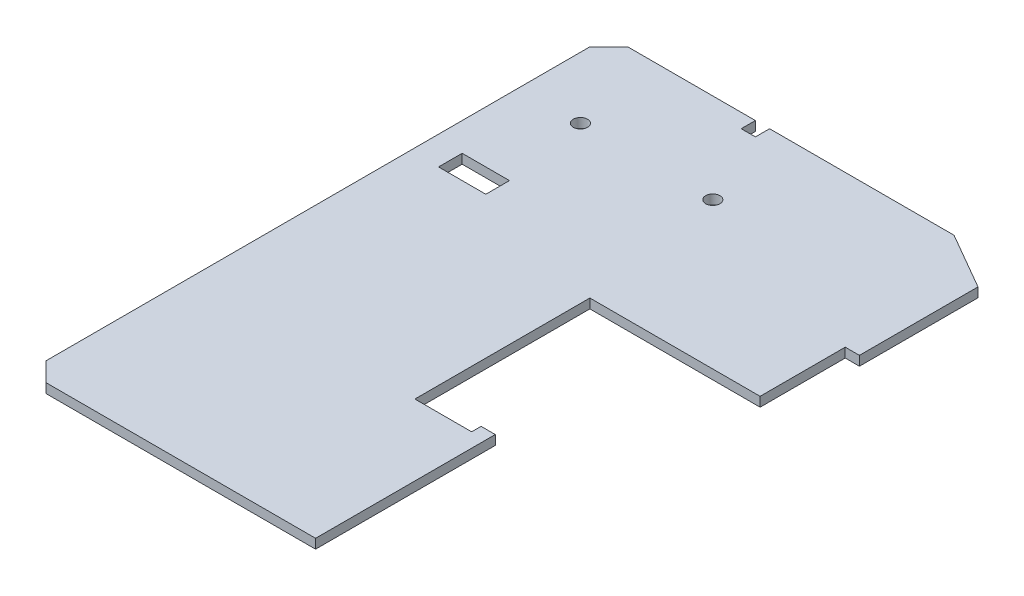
ISO-10303-21;
HEADER;
FILE_DESCRIPTION(('STEP AP214'),'2;1');
FILE_NAME('part.step','',(''),(''),'','','');
FILE_SCHEMA(('AUTOMOTIVE_DESIGN { 1 0 10303 214 1 1 1 1 }'));
ENDSEC;
DATA;
#1=APPLICATION_CONTEXT('core data for automotive mechanical design processes');
#2=APPLICATION_PROTOCOL_DEFINITION('international standard','automotive_design',2000,#1);
#3=PRODUCT_CONTEXT('',#1,'mechanical');
#4=PRODUCT('Part','Part','',(#3));
#5=PRODUCT_RELATED_PRODUCT_CATEGORY('part','',(#4));
#6=PRODUCT_DEFINITION_FORMATION('','',#4);
#7=PRODUCT_DEFINITION_CONTEXT('part definition',#1,'design');
#8=PRODUCT_DEFINITION('design','',#6,#7);
#9=PRODUCT_DEFINITION_SHAPE('','',#8);
#10=(LENGTH_UNIT() NAMED_UNIT(*) SI_UNIT(.MILLI.,.METRE.));
#11=(NAMED_UNIT(*) PLANE_ANGLE_UNIT() SI_UNIT($,.RADIAN.));
#12=(NAMED_UNIT(*) SI_UNIT($,.STERADIAN.) SOLID_ANGLE_UNIT());
#13=UNCERTAINTY_MEASURE_WITH_UNIT(LENGTH_MEASURE(1.E-05),#10,'distance_accuracy_value','');
#14=(GEOMETRIC_REPRESENTATION_CONTEXT(3) GLOBAL_UNCERTAINTY_ASSIGNED_CONTEXT((#13)) GLOBAL_UNIT_ASSIGNED_CONTEXT((#10,
#11,#12)) REPRESENTATION_CONTEXT('',''));
#15=CARTESIAN_POINT('',(0.,0.,0.));
#16=DIRECTION('',(0.,0.,1.));
#17=DIRECTION('',(1.,0.,0.));
#18=AXIS2_PLACEMENT_3D('',#15,#16,#17);
#19=CARTESIAN_POINT('',(-51.75,1.,-12.7500000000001));
#20=DIRECTION('',(0.,-1.,0.));
#21=DIRECTION('',(0.,0.,-1.));
#22=AXIS2_PLACEMENT_3D('',#19,#20,#21);
#23=PLANE('',#22);
#24=CARTESIAN_POINT('',(-16.5,1.,-34.));
#25=DIRECTION('',(0.,1.,0.));
#26=DIRECTION('',(0.,0.,1.));
#27=AXIS2_PLACEMENT_3D('',#24,#25,#26);
#28=CIRCLE('',#27,0.750000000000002);
#29=CARTESIAN_POINT('',(-16.5,1.,-33.25));
#30=VERTEX_POINT('',#29);
#31=EDGE_CURVE('E212',#30,#30,#28,.T.);
#32=ORIENTED_EDGE('',*,*,#31,.F.);
#33=EDGE_LOOP('',(#32));
#34=FACE_BOUND('',#33,.T.);
#35=DIRECTION('',(0.707106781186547,0.,0.707106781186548));
#36=VECTOR('',#35,1.);
#37=CARTESIAN_POINT('',(-21.,1.,18.));
#38=LINE('',#37,#36);
#39=CARTESIAN_POINT('',(-23.,1.,16.));
#40=VERTEX_POINT('',#39);
#41=CARTESIAN_POINT('',(-21.,1.,18.));
#42=VERTEX_POINT('',#41);
#43=EDGE_CURVE('E270',#40,#42,#38,.T.);
#44=ORIENTED_EDGE('',*,*,#43,.T.);
#45=DIRECTION('',(1.,0.,0.));
#46=VECTOR('',#45,1.);
#47=CARTESIAN_POINT('',(7.5,1.,18.));
#48=LINE('',#47,#46);
#49=CARTESIAN_POINT('',(7.5,1.,18.));
#50=VERTEX_POINT('',#49);
#51=EDGE_CURVE('E273',#42,#50,#48,.T.);
#52=ORIENTED_EDGE('',*,*,#51,.T.);
#53=DIRECTION('',(0.,0.,-1.));
#54=VECTOR('',#53,1.);
#55=CARTESIAN_POINT('',(7.5,1.,-1.));
#56=LINE('',#55,#54);
#57=CARTESIAN_POINT('',(7.5,1.,-1.));
#58=VERTEX_POINT('',#57);
#59=EDGE_CURVE('E275',#50,#58,#56,.T.);
#60=ORIENTED_EDGE('',*,*,#59,.T.);
#61=DIRECTION('',(-1.,0.,0.));
#62=VECTOR('',#61,1.);
#63=CARTESIAN_POINT('',(6.,1.,-1.));
#64=LINE('',#63,#62);
#65=CARTESIAN_POINT('',(6.,1.,-1.));
#66=VERTEX_POINT('',#65);
#67=EDGE_CURVE('E277',#58,#66,#64,.T.);
#68=ORIENTED_EDGE('',*,*,#67,.T.);
#69=DIRECTION('',(0.,0.,1.));
#70=VECTOR('',#69,1.);
#71=CARTESIAN_POINT('',(6.,1.,0.));
#72=LINE('',#71,#70);
#73=CARTESIAN_POINT('',(6.,1.,0.));
#74=VERTEX_POINT('',#73);
#75=EDGE_CURVE('E279',#66,#74,#72,.T.);
#76=ORIENTED_EDGE('',*,*,#75,.T.);
#77=DIRECTION('',(-1.,0.,0.));
#78=VECTOR('',#77,1.);
#79=CARTESIAN_POINT('',(0.,1.,0.));
#80=LINE('',#79,#78);
#81=CARTESIAN_POINT('',(0.,1.,0.));
#82=VERTEX_POINT('',#81);
#83=EDGE_CURVE('E281',#74,#82,#80,.T.);
#84=ORIENTED_EDGE('',*,*,#83,.T.);
#85=DIRECTION('',(0.,0.,-1.));
#86=VECTOR('',#85,1.);
#87=CARTESIAN_POINT('',(0.,1.,-18.5));
#88=LINE('',#87,#86);
#89=CARTESIAN_POINT('',(0.,1.,-18.5));
#90=VERTEX_POINT('',#89);
#91=EDGE_CURVE('E283',#82,#90,#88,.T.);
#92=ORIENTED_EDGE('',*,*,#91,.T.);
#93=DIRECTION('',(1.,0.,0.));
#94=VECTOR('',#93,1.);
#95=CARTESIAN_POINT('',(18.,1.,-18.5));
#96=LINE('',#95,#94);
#97=CARTESIAN_POINT('',(18.,1.,-18.5));
#98=VERTEX_POINT('',#97);
#99=EDGE_CURVE('E285',#90,#98,#96,.T.);
#100=ORIENTED_EDGE('',*,*,#99,.T.);
#101=DIRECTION('',(0.,0.,-1.));
#102=VECTOR('',#101,1.);
#103=CARTESIAN_POINT('',(18.,1.,-27.5));
#104=LINE('',#103,#102);
#105=CARTESIAN_POINT('',(18.,1.,-27.5));
#106=VERTEX_POINT('',#105);
#107=EDGE_CURVE('E287',#98,#106,#104,.T.);
#108=ORIENTED_EDGE('',*,*,#107,.T.);
#109=DIRECTION('',(1.,0.,0.));
#110=VECTOR('',#109,1.);
#111=CARTESIAN_POINT('',(19.5,1.,-27.5));
#112=LINE('',#111,#110);
#113=CARTESIAN_POINT('',(19.5,1.,-27.5));
#114=VERTEX_POINT('',#113);
#115=EDGE_CURVE('E289',#106,#114,#112,.T.);
#116=ORIENTED_EDGE('',*,*,#115,.T.);
#117=DIRECTION('',(0.,0.,-1.));
#118=VECTOR('',#117,1.);
#119=CARTESIAN_POINT('',(19.5,1.,-40.0358983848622));
#120=LINE('',#119,#118);
#121=CARTESIAN_POINT('',(19.5,1.,-40.0358983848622));
#122=VERTEX_POINT('',#121);
#123=EDGE_CURVE('E291',#114,#122,#120,.T.);
#124=ORIENTED_EDGE('',*,*,#123,.T.);
#125=DIRECTION('',(-0.866025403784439,0.,-0.5));
#126=VECTOR('',#125,1.);
#127=CARTESIAN_POINT('',(13.5,1.,-43.5));
#128=LINE('',#127,#126);
#129=CARTESIAN_POINT('',(13.5,1.,-43.5));
#130=VERTEX_POINT('',#129);
#131=EDGE_CURVE('E293',#122,#130,#128,.T.);
#132=ORIENTED_EDGE('',*,*,#131,.T.);
#133=DIRECTION('',(-1.,0.,0.));
#134=VECTOR('',#133,1.);
#135=CARTESIAN_POINT('',(-6.,1.,-43.5));
#136=LINE('',#135,#134);
#137=CARTESIAN_POINT('',(-6.,1.,-43.5));
#138=VERTEX_POINT('',#137);
#139=EDGE_CURVE('E295',#130,#138,#136,.T.);
#140=ORIENTED_EDGE('',*,*,#139,.T.);
#141=DIRECTION('',(0.,0.,1.));
#142=VECTOR('',#141,1.);
#143=CARTESIAN_POINT('',(-6.,1.,-42.));
#144=LINE('',#143,#142);
#145=CARTESIAN_POINT('',(-6.,1.,-42.));
#146=VERTEX_POINT('',#145);
#147=EDGE_CURVE('E297',#138,#146,#144,.T.);
#148=ORIENTED_EDGE('',*,*,#147,.T.);
#149=DIRECTION('',(-1.,0.,0.));
#150=VECTOR('',#149,1.);
#151=CARTESIAN_POINT('',(-7.5,1.,-42.));
#152=LINE('',#151,#150);
#153=CARTESIAN_POINT('',(-7.5,1.,-42.));
#154=VERTEX_POINT('',#153);
#155=EDGE_CURVE('E299',#146,#154,#152,.T.);
#156=ORIENTED_EDGE('',*,*,#155,.T.);
#157=DIRECTION('',(0.,0.,-1.));
#158=VECTOR('',#157,1.);
#159=CARTESIAN_POINT('',(-7.5,1.,-43.5));
#160=LINE('',#159,#158);
#161=CARTESIAN_POINT('',(-7.5,1.,-43.5));
#162=VERTEX_POINT('',#161);
#163=EDGE_CURVE('E301',#154,#162,#160,.T.);
#164=ORIENTED_EDGE('',*,*,#163,.T.);
#165=DIRECTION('',(-1.,0.,0.));
#166=VECTOR('',#165,1.);
#167=CARTESIAN_POINT('',(-21.,1.,-43.5));
#168=LINE('',#167,#166);
#169=CARTESIAN_POINT('',(-21.,1.,-43.5));
#170=VERTEX_POINT('',#169);
#171=EDGE_CURVE('E303',#162,#170,#168,.T.);
#172=ORIENTED_EDGE('',*,*,#171,.T.);
#173=DIRECTION('',(-0.707106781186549,0.,0.707106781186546));
#174=VECTOR('',#173,1.);
#175=CARTESIAN_POINT('',(-23.,1.,-41.5));
#176=LINE('',#175,#174);
#177=CARTESIAN_POINT('',(-23.,1.,-41.5));
#178=VERTEX_POINT('',#177);
#179=EDGE_CURVE('E305',#170,#178,#176,.T.);
#180=ORIENTED_EDGE('',*,*,#179,.T.);
#181=DIRECTION('',(0.,0.,1.));
#182=VECTOR('',#181,1.);
#183=CARTESIAN_POINT('',(-23.,1.,16.));
#184=LINE('',#183,#182);
#185=EDGE_CURVE('E307',#178,#40,#184,.T.);
#186=ORIENTED_EDGE('',*,*,#185,.T.);
#187=EDGE_LOOP('',(#44,#52,#60,#68,#76,#84,#92,#100,#108,#116,#124,#132,#140,#148,#156,#164,
#172,#180,#186));
#188=FACE_BOUND('',#187,.T.);
#189=DIRECTION('',(0.,0.,1.));
#190=VECTOR('',#189,1.);
#191=CARTESIAN_POINT('',(-20.,1.,-25.));
#192=LINE('',#191,#190);
#193=CARTESIAN_POINT('',(-20.,1.,-25.));
#194=VERTEX_POINT('',#193);
#195=CARTESIAN_POINT('',(-20.,1.,-22.5));
#196=VERTEX_POINT('',#195);
#197=EDGE_CURVE('E205',#194,#196,#192,.T.);
#198=ORIENTED_EDGE('',*,*,#197,.F.);
#199=DIRECTION('',(-1.,0.,0.));
#200=VECTOR('',#199,1.);
#201=CARTESIAN_POINT('',(-20.,1.,-25.));
#202=LINE('',#201,#200);
#203=CARTESIAN_POINT('',(-15.,1.,-25.));
#204=VERTEX_POINT('',#203);
#205=EDGE_CURVE('E226',#204,#194,#202,.T.);
#206=ORIENTED_EDGE('',*,*,#205,.F.);
#207=DIRECTION('',(0.,0.,-1.));
#208=VECTOR('',#207,1.);
#209=CARTESIAN_POINT('',(-15.,1.,-25.));
#210=LINE('',#209,#208);
#211=CARTESIAN_POINT('',(-15.,1.,-22.5));
#212=VERTEX_POINT('',#211);
#213=EDGE_CURVE('E224',#212,#204,#210,.T.);
#214=ORIENTED_EDGE('',*,*,#213,.F.);
#215=DIRECTION('',(1.,0.,0.));
#216=VECTOR('',#215,1.);
#217=CARTESIAN_POINT('',(-20.,1.,-22.5));
#218=LINE('',#217,#216);
#219=EDGE_CURVE('E222',#196,#212,#218,.T.);
#220=ORIENTED_EDGE('',*,*,#219,.F.);
#221=EDGE_LOOP('',(#198,#206,#214,#220));
#222=FACE_BOUND('',#221,.T.);
#223=CARTESIAN_POINT('',(-2.5,1.,-34.));
#224=DIRECTION('',(0.,1.,0.));
#225=DIRECTION('',(0.,0.,1.));
#226=AXIS2_PLACEMENT_3D('',#223,#224,#225);
#227=CIRCLE('',#226,0.750000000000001);
#228=CARTESIAN_POINT('',(-2.5,1.,-33.25));
#229=VERTEX_POINT('',#228);
#230=EDGE_CURVE('E684',#229,#229,#227,.T.);
#231=ORIENTED_EDGE('',*,*,#230,.F.);
#232=EDGE_LOOP('',(#231));
#233=FACE_BOUND('',#232,.T.);
#234=ADVANCED_FACE('F35',(#34,#188,#222,#233),#23,.F.);
#235=CARTESIAN_POINT('',(-51.75,0.,-12.7500000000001));
#236=DIRECTION('',(0.,-1.,0.));
#237=DIRECTION('',(0.,0.,-1.));
#238=AXIS2_PLACEMENT_3D('',#235,#236,#237);
#239=PLANE('',#238);
#240=CARTESIAN_POINT('',(-16.5,0.,-34.));
#241=DIRECTION('',(0.,1.,0.));
#242=DIRECTION('',(0.,0.,1.));
#243=AXIS2_PLACEMENT_3D('',#240,#241,#242);
#244=CIRCLE('',#243,0.750000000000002);
#245=CARTESIAN_POINT('',(-16.5,0.,-33.25));
#246=VERTEX_POINT('',#245);
#247=EDGE_CURVE('E215',#246,#246,#244,.T.);
#248=ORIENTED_EDGE('',*,*,#247,.T.);
#249=EDGE_LOOP('',(#248));
#250=FACE_BOUND('',#249,.T.);
#251=DIRECTION('',(0.707106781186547,0.,0.707106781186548));
#252=VECTOR('',#251,1.);
#253=CARTESIAN_POINT('',(-21.,0.,18.));
#254=LINE('',#253,#252);
#255=CARTESIAN_POINT('',(-23.,0.,16.));
#256=VERTEX_POINT('',#255);
#257=CARTESIAN_POINT('',(-21.,0.,18.));
#258=VERTEX_POINT('',#257);
#259=EDGE_CURVE('E206',#256,#258,#254,.T.);
#260=ORIENTED_EDGE('',*,*,#259,.F.);
#261=DIRECTION('',(0.,0.,1.));
#262=VECTOR('',#261,1.);
#263=CARTESIAN_POINT('',(-23.,0.,16.));
#264=LINE('',#263,#262);
#265=CARTESIAN_POINT('',(-23.,0.,-41.5));
#266=VERTEX_POINT('',#265);
#267=EDGE_CURVE('E268',#266,#256,#264,.T.);
#268=ORIENTED_EDGE('',*,*,#267,.F.);
#269=DIRECTION('',(-0.707106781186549,0.,0.707106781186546));
#270=VECTOR('',#269,1.);
#271=CARTESIAN_POINT('',(-23.,0.,-41.5));
#272=LINE('',#271,#270);
#273=CARTESIAN_POINT('',(-21.,0.,-43.5));
#274=VERTEX_POINT('',#273);
#275=EDGE_CURVE('E266',#274,#266,#272,.T.);
#276=ORIENTED_EDGE('',*,*,#275,.F.);
#277=DIRECTION('',(-1.,0.,0.));
#278=VECTOR('',#277,1.);
#279=CARTESIAN_POINT('',(-21.,0.,-43.5));
#280=LINE('',#279,#278);
#281=CARTESIAN_POINT('',(-7.5,0.,-43.5));
#282=VERTEX_POINT('',#281);
#283=EDGE_CURVE('E264',#282,#274,#280,.T.);
#284=ORIENTED_EDGE('',*,*,#283,.F.);
#285=DIRECTION('',(0.,0.,-1.));
#286=VECTOR('',#285,1.);
#287=CARTESIAN_POINT('',(-7.5,0.,-43.5));
#288=LINE('',#287,#286);
#289=CARTESIAN_POINT('',(-7.5,0.,-42.));
#290=VERTEX_POINT('',#289);
#291=EDGE_CURVE('E262',#290,#282,#288,.T.);
#292=ORIENTED_EDGE('',*,*,#291,.F.);
#293=DIRECTION('',(-1.,0.,0.));
#294=VECTOR('',#293,1.);
#295=CARTESIAN_POINT('',(-7.5,0.,-42.));
#296=LINE('',#295,#294);
#297=CARTESIAN_POINT('',(-6.,0.,-42.));
#298=VERTEX_POINT('',#297);
#299=EDGE_CURVE('E260',#298,#290,#296,.T.);
#300=ORIENTED_EDGE('',*,*,#299,.F.);
#301=DIRECTION('',(0.,0.,1.));
#302=VECTOR('',#301,1.);
#303=CARTESIAN_POINT('',(-6.,0.,-42.));
#304=LINE('',#303,#302);
#305=CARTESIAN_POINT('',(-6.,0.,-43.5));
#306=VERTEX_POINT('',#305);
#307=EDGE_CURVE('E258',#306,#298,#304,.T.);
#308=ORIENTED_EDGE('',*,*,#307,.F.);
#309=DIRECTION('',(-1.,0.,0.));
#310=VECTOR('',#309,1.);
#311=CARTESIAN_POINT('',(-6.,0.,-43.5));
#312=LINE('',#311,#310);
#313=CARTESIAN_POINT('',(13.5,0.,-43.5));
#314=VERTEX_POINT('',#313);
#315=EDGE_CURVE('E256',#314,#306,#312,.T.);
#316=ORIENTED_EDGE('',*,*,#315,.F.);
#317=DIRECTION('',(-0.866025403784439,0.,-0.5));
#318=VECTOR('',#317,1.);
#319=CARTESIAN_POINT('',(13.5,0.,-43.5));
#320=LINE('',#319,#318);
#321=CARTESIAN_POINT('',(19.5,0.,-40.0358983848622));
#322=VERTEX_POINT('',#321);
#323=EDGE_CURVE('E254',#322,#314,#320,.T.);
#324=ORIENTED_EDGE('',*,*,#323,.F.);
#325=DIRECTION('',(0.,0.,-1.));
#326=VECTOR('',#325,1.);
#327=CARTESIAN_POINT('',(19.5,0.,-40.0358983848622));
#328=LINE('',#327,#326);
#329=CARTESIAN_POINT('',(19.5,0.,-27.5));
#330=VERTEX_POINT('',#329);
#331=EDGE_CURVE('E252',#330,#322,#328,.T.);
#332=ORIENTED_EDGE('',*,*,#331,.F.);
#333=DIRECTION('',(1.,0.,0.));
#334=VECTOR('',#333,1.);
#335=CARTESIAN_POINT('',(19.5,0.,-27.5));
#336=LINE('',#335,#334);
#337=CARTESIAN_POINT('',(18.,0.,-27.5));
#338=VERTEX_POINT('',#337);
#339=EDGE_CURVE('E250',#338,#330,#336,.T.);
#340=ORIENTED_EDGE('',*,*,#339,.F.);
#341=DIRECTION('',(0.,0.,-1.));
#342=VECTOR('',#341,1.);
#343=CARTESIAN_POINT('',(18.,0.,-27.5));
#344=LINE('',#343,#342);
#345=CARTESIAN_POINT('',(18.,0.,-18.5));
#346=VERTEX_POINT('',#345);
#347=EDGE_CURVE('E248',#346,#338,#344,.T.);
#348=ORIENTED_EDGE('',*,*,#347,.F.);
#349=DIRECTION('',(1.,0.,0.));
#350=VECTOR('',#349,1.);
#351=CARTESIAN_POINT('',(18.,0.,-18.5));
#352=LINE('',#351,#350);
#353=CARTESIAN_POINT('',(0.,0.,-18.5));
#354=VERTEX_POINT('',#353);
#355=EDGE_CURVE('E246',#354,#346,#352,.T.);
#356=ORIENTED_EDGE('',*,*,#355,.F.);
#357=DIRECTION('',(0.,0.,-1.));
#358=VECTOR('',#357,1.);
#359=CARTESIAN_POINT('',(0.,0.,-18.5));
#360=LINE('',#359,#358);
#361=CARTESIAN_POINT('',(0.,0.,0.));
#362=VERTEX_POINT('',#361);
#363=EDGE_CURVE('E244',#362,#354,#360,.T.);
#364=ORIENTED_EDGE('',*,*,#363,.F.);
#365=DIRECTION('',(-1.,0.,0.));
#366=VECTOR('',#365,1.);
#367=CARTESIAN_POINT('',(0.,0.,0.));
#368=LINE('',#367,#366);
#369=CARTESIAN_POINT('',(6.,0.,0.));
#370=VERTEX_POINT('',#369);
#371=EDGE_CURVE('E242',#370,#362,#368,.T.);
#372=ORIENTED_EDGE('',*,*,#371,.F.);
#373=DIRECTION('',(0.,0.,1.));
#374=VECTOR('',#373,1.);
#375=CARTESIAN_POINT('',(6.,0.,0.));
#376=LINE('',#375,#374);
#377=CARTESIAN_POINT('',(6.,0.,-1.));
#378=VERTEX_POINT('',#377);
#379=EDGE_CURVE('E240',#378,#370,#376,.T.);
#380=ORIENTED_EDGE('',*,*,#379,.F.);
#381=DIRECTION('',(-1.,0.,0.));
#382=VECTOR('',#381,1.);
#383=CARTESIAN_POINT('',(6.,0.,-1.));
#384=LINE('',#383,#382);
#385=CARTESIAN_POINT('',(7.5,0.,-1.));
#386=VERTEX_POINT('',#385);
#387=EDGE_CURVE('E238',#386,#378,#384,.T.);
#388=ORIENTED_EDGE('',*,*,#387,.F.);
#389=DIRECTION('',(0.,0.,-1.));
#390=VECTOR('',#389,1.);
#391=CARTESIAN_POINT('',(7.5,0.,-1.));
#392=LINE('',#391,#390);
#393=CARTESIAN_POINT('',(7.5,0.,18.));
#394=VERTEX_POINT('',#393);
#395=EDGE_CURVE('E236',#394,#386,#392,.T.);
#396=ORIENTED_EDGE('',*,*,#395,.F.);
#397=DIRECTION('',(1.,0.,0.));
#398=VECTOR('',#397,1.);
#399=CARTESIAN_POINT('',(7.5,0.,18.));
#400=LINE('',#399,#398);
#401=EDGE_CURVE('E234',#258,#394,#400,.T.);
#402=ORIENTED_EDGE('',*,*,#401,.F.);
#403=EDGE_LOOP('',(#260,#268,#276,#284,#292,#300,#308,#316,#324,#332,#340,#348,#356,#364,#372,
#380,#388,#396,#402));
#404=FACE_BOUND('',#403,.T.);
#405=DIRECTION('',(-1.,0.,0.));
#406=VECTOR('',#405,1.);
#407=CARTESIAN_POINT('',(-20.,0.,-25.));
#408=LINE('',#407,#406);
#409=CARTESIAN_POINT('',(-15.,0.,-25.));
#410=VERTEX_POINT('',#409);
#411=CARTESIAN_POINT('',(-20.,0.,-25.));
#412=VERTEX_POINT('',#411);
#413=EDGE_CURVE('E211',#410,#412,#408,.T.);
#414=ORIENTED_EDGE('',*,*,#413,.T.);
#415=DIRECTION('',(0.,0.,1.));
#416=VECTOR('',#415,1.);
#417=CARTESIAN_POINT('',(-20.,0.,-25.));
#418=LINE('',#417,#416);
#419=CARTESIAN_POINT('',(-20.,0.,-22.5));
#420=VERTEX_POINT('',#419);
#421=EDGE_CURVE('E58',#412,#420,#418,.T.);
#422=ORIENTED_EDGE('',*,*,#421,.T.);
#423=DIRECTION('',(1.,0.,0.));
#424=VECTOR('',#423,1.);
#425=CARTESIAN_POINT('',(-20.,0.,-22.5));
#426=LINE('',#425,#424);
#427=CARTESIAN_POINT('',(-15.,0.,-22.5));
#428=VERTEX_POINT('',#427);
#429=EDGE_CURVE('E192',#420,#428,#426,.T.);
#430=ORIENTED_EDGE('',*,*,#429,.T.);
#431=DIRECTION('',(0.,0.,-1.));
#432=VECTOR('',#431,1.);
#433=CARTESIAN_POINT('',(-15.,0.,-25.));
#434=LINE('',#433,#432);
#435=EDGE_CURVE('E201',#428,#410,#434,.T.);
#436=ORIENTED_EDGE('',*,*,#435,.T.);
#437=EDGE_LOOP('',(#414,#422,#430,#436));
#438=FACE_BOUND('',#437,.T.);
#439=CARTESIAN_POINT('',(-2.5,0.,-34.));
#440=DIRECTION('',(0.,1.,0.));
#441=DIRECTION('',(0.,0.,1.));
#442=AXIS2_PLACEMENT_3D('',#439,#440,#441);
#443=CIRCLE('',#442,0.750000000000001);
#444=CARTESIAN_POINT('',(-2.5,0.,-33.25));
#445=VERTEX_POINT('',#444);
#446=EDGE_CURVE('E687',#445,#445,#443,.T.);
#447=ORIENTED_EDGE('',*,*,#446,.T.);
#448=EDGE_LOOP('',(#447));
#449=FACE_BOUND('',#448,.T.);
#450=ADVANCED_FACE('F209',(#250,#404,#438,#449),#239,.T.);
#451=CARTESIAN_POINT('',(-21.,1.,18.));
#452=DIRECTION('',(0.707106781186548,0.,-0.707106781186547));
#453=DIRECTION('',(-0.707106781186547,0.,-0.707106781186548));
#454=AXIS2_PLACEMENT_3D('',#451,#452,#453);
#455=PLANE('',#454);
#456=ORIENTED_EDGE('',*,*,#259,.T.);
#457=DIRECTION('',(0.,-1.,0.));
#458=VECTOR('',#457,1.);
#459=CARTESIAN_POINT('',(-21.,1.,18.));
#460=LINE('',#459,#458);
#461=EDGE_CURVE('E11',#42,#258,#460,.T.);
#462=ORIENTED_EDGE('',*,*,#461,.F.);
#463=ORIENTED_EDGE('',*,*,#43,.F.);
#464=DIRECTION('',(0.,-1.,0.));
#465=VECTOR('',#464,1.);
#466=CARTESIAN_POINT('',(-23.,1.,16.));
#467=LINE('',#466,#465);
#468=EDGE_CURVE('E309',#40,#256,#467,.T.);
#469=ORIENTED_EDGE('',*,*,#468,.T.);
#470=EDGE_LOOP('',(#456,#462,#463,#469));
#471=FACE_BOUND('',#470,.T.);
#472=ADVANCED_FACE('F37',(#471),#455,.F.);
#473=CARTESIAN_POINT('',(7.5,1.,18.));
#474=DIRECTION('',(0.,0.,-1.));
#475=DIRECTION('',(-1.,0.,0.));
#476=AXIS2_PLACEMENT_3D('',#473,#474,#475);
#477=PLANE('',#476);
#478=ORIENTED_EDGE('',*,*,#401,.T.);
#479=DIRECTION('',(0.,-1.,0.));
#480=VECTOR('',#479,1.);
#481=CARTESIAN_POINT('',(7.5,1.,18.));
#482=LINE('',#481,#480);
#483=EDGE_CURVE('E43',#50,#394,#482,.T.);
#484=ORIENTED_EDGE('',*,*,#483,.F.);
#485=ORIENTED_EDGE('',*,*,#51,.F.);
#486=ORIENTED_EDGE('',*,*,#461,.T.);
#487=EDGE_LOOP('',(#478,#484,#485,#486));
#488=FACE_BOUND('',#487,.T.);
#489=ADVANCED_FACE('F386',(#488),#477,.F.);
#490=CARTESIAN_POINT('',(7.5,1.,-1.));
#491=DIRECTION('',(-1.,0.,0.));
#492=DIRECTION('',(0.,0.,1.));
#493=AXIS2_PLACEMENT_3D('',#490,#491,#492);
#494=PLANE('',#493);
#495=ORIENTED_EDGE('',*,*,#395,.T.);
#496=DIRECTION('',(0.,-1.,0.));
#497=VECTOR('',#496,1.);
#498=CARTESIAN_POINT('',(7.5,1.,-1.));
#499=LINE('',#498,#497);
#500=EDGE_CURVE('E357',#58,#386,#499,.T.);
#501=ORIENTED_EDGE('',*,*,#500,.F.);
#502=ORIENTED_EDGE('',*,*,#59,.F.);
#503=ORIENTED_EDGE('',*,*,#483,.T.);
#504=EDGE_LOOP('',(#495,#501,#502,#503));
#505=FACE_BOUND('',#504,.T.);
#506=ADVANCED_FACE('F364',(#505),#494,.F.);
#507=CARTESIAN_POINT('',(6.,1.,-1.));
#508=DIRECTION('',(0.,0.,1.));
#509=DIRECTION('',(1.,0.,0.));
#510=AXIS2_PLACEMENT_3D('',#507,#508,#509);
#511=PLANE('',#510);
#512=ORIENTED_EDGE('',*,*,#387,.T.);
#513=DIRECTION('',(0.,-1.,0.));
#514=VECTOR('',#513,1.);
#515=CARTESIAN_POINT('',(6.,1.,-1.));
#516=LINE('',#515,#514);
#517=EDGE_CURVE('E354',#66,#378,#516,.T.);
#518=ORIENTED_EDGE('',*,*,#517,.F.);
#519=ORIENTED_EDGE('',*,*,#67,.F.);
#520=ORIENTED_EDGE('',*,*,#500,.T.);
#521=EDGE_LOOP('',(#512,#518,#519,#520));
#522=FACE_BOUND('',#521,.T.);
#523=ADVANCED_FACE('F374',(#522),#511,.F.);
#524=CARTESIAN_POINT('',(6.,1.,0.));
#525=DIRECTION('',(1.,0.,0.));
#526=DIRECTION('',(0.,0.,-1.));
#527=AXIS2_PLACEMENT_3D('',#524,#525,#526);
#528=PLANE('',#527);
#529=ORIENTED_EDGE('',*,*,#379,.T.);
#530=DIRECTION('',(0.,-1.,0.));
#531=VECTOR('',#530,1.);
#532=CARTESIAN_POINT('',(6.,1.,0.));
#533=LINE('',#532,#531);
#534=EDGE_CURVE('E351',#74,#370,#533,.T.);
#535=ORIENTED_EDGE('',*,*,#534,.F.);
#536=ORIENTED_EDGE('',*,*,#75,.F.);
#537=ORIENTED_EDGE('',*,*,#517,.T.);
#538=EDGE_LOOP('',(#529,#535,#536,#537));
#539=FACE_BOUND('',#538,.T.);
#540=ADVANCED_FACE('F378',(#539),#528,.F.);
#541=CARTESIAN_POINT('',(0.,1.,0.));
#542=DIRECTION('',(0.,0.,1.));
#543=DIRECTION('',(1.,0.,0.));
#544=AXIS2_PLACEMENT_3D('',#541,#542,#543);
#545=PLANE('',#544);
#546=ORIENTED_EDGE('',*,*,#371,.T.);
#547=DIRECTION('',(0.,-1.,0.));
#548=VECTOR('',#547,1.);
#549=CARTESIAN_POINT('',(0.,1.,0.));
#550=LINE('',#549,#548);
#551=EDGE_CURVE('E348',#82,#362,#550,.T.);
#552=ORIENTED_EDGE('',*,*,#551,.F.);
#553=ORIENTED_EDGE('',*,*,#83,.F.);
#554=ORIENTED_EDGE('',*,*,#534,.T.);
#555=EDGE_LOOP('',(#546,#552,#553,#554));
#556=FACE_BOUND('',#555,.T.);
#557=ADVANCED_FACE('F454',(#556),#545,.F.);
#558=CARTESIAN_POINT('',(0.,1.,-18.5));
#559=DIRECTION('',(-1.,0.,0.));
#560=DIRECTION('',(0.,0.,1.));
#561=AXIS2_PLACEMENT_3D('',#558,#559,#560);
#562=PLANE('',#561);
#563=ORIENTED_EDGE('',*,*,#363,.T.);
#564=DIRECTION('',(0.,-1.,0.));
#565=VECTOR('',#564,1.);
#566=CARTESIAN_POINT('',(0.,1.,-18.5));
#567=LINE('',#566,#565);
#568=EDGE_CURVE('E345',#90,#354,#567,.T.);
#569=ORIENTED_EDGE('',*,*,#568,.F.);
#570=ORIENTED_EDGE('',*,*,#91,.F.);
#571=ORIENTED_EDGE('',*,*,#551,.T.);
#572=EDGE_LOOP('',(#563,#569,#570,#571));
#573=FACE_BOUND('',#572,.T.);
#574=ADVANCED_FACE('F451',(#573),#562,.F.);
#575=CARTESIAN_POINT('',(18.,1.,-18.5));
#576=DIRECTION('',(0.,0.,-1.));
#577=DIRECTION('',(-1.,0.,0.));
#578=AXIS2_PLACEMENT_3D('',#575,#576,#577);
#579=PLANE('',#578);
#580=ORIENTED_EDGE('',*,*,#355,.T.);
#581=DIRECTION('',(0.,-1.,0.));
#582=VECTOR('',#581,1.);
#583=CARTESIAN_POINT('',(18.,1.,-18.5));
#584=LINE('',#583,#582);
#585=EDGE_CURVE('E342',#98,#346,#584,.T.);
#586=ORIENTED_EDGE('',*,*,#585,.F.);
#587=ORIENTED_EDGE('',*,*,#99,.F.);
#588=ORIENTED_EDGE('',*,*,#568,.T.);
#589=EDGE_LOOP('',(#580,#586,#587,#588));
#590=FACE_BOUND('',#589,.T.);
#591=ADVANCED_FACE('F447',(#590),#579,.F.);
#592=CARTESIAN_POINT('',(18.,1.,-27.5));
#593=DIRECTION('',(-1.,0.,0.));
#594=DIRECTION('',(0.,0.,1.));
#595=AXIS2_PLACEMENT_3D('',#592,#593,#594);
#596=PLANE('',#595);
#597=ORIENTED_EDGE('',*,*,#347,.T.);
#598=DIRECTION('',(0.,-1.,0.));
#599=VECTOR('',#598,1.);
#600=CARTESIAN_POINT('',(18.,1.,-27.5));
#601=LINE('',#600,#599);
#602=EDGE_CURVE('E339',#106,#338,#601,.T.);
#603=ORIENTED_EDGE('',*,*,#602,.F.);
#604=ORIENTED_EDGE('',*,*,#107,.F.);
#605=ORIENTED_EDGE('',*,*,#585,.T.);
#606=EDGE_LOOP('',(#597,#603,#604,#605));
#607=FACE_BOUND('',#606,.T.);
#608=ADVANCED_FACE('F443',(#607),#596,.F.);
#609=CARTESIAN_POINT('',(19.5,1.,-27.5));
#610=DIRECTION('',(0.,0.,-1.));
#611=DIRECTION('',(-1.,0.,0.));
#612=AXIS2_PLACEMENT_3D('',#609,#610,#611);
#613=PLANE('',#612);
#614=ORIENTED_EDGE('',*,*,#339,.T.);
#615=DIRECTION('',(0.,-1.,0.));
#616=VECTOR('',#615,1.);
#617=CARTESIAN_POINT('',(19.5,1.,-27.5));
#618=LINE('',#617,#616);
#619=EDGE_CURVE('E336',#114,#330,#618,.T.);
#620=ORIENTED_EDGE('',*,*,#619,.F.);
#621=ORIENTED_EDGE('',*,*,#115,.F.);
#622=ORIENTED_EDGE('',*,*,#602,.T.);
#623=EDGE_LOOP('',(#614,#620,#621,#622));
#624=FACE_BOUND('',#623,.T.);
#625=ADVANCED_FACE('F438',(#624),#613,.F.);
#626=CARTESIAN_POINT('',(19.5,1.,-40.0358983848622));
#627=DIRECTION('',(-1.,0.,0.));
#628=DIRECTION('',(0.,0.,1.));
#629=AXIS2_PLACEMENT_3D('',#626,#627,#628);
#630=PLANE('',#629);
#631=ORIENTED_EDGE('',*,*,#331,.T.);
#632=DIRECTION('',(0.,-1.,0.));
#633=VECTOR('',#632,1.);
#634=CARTESIAN_POINT('',(19.5,1.,-40.0358983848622));
#635=LINE('',#634,#633);
#636=EDGE_CURVE('E333',#122,#322,#635,.T.);
#637=ORIENTED_EDGE('',*,*,#636,.F.);
#638=ORIENTED_EDGE('',*,*,#123,.F.);
#639=ORIENTED_EDGE('',*,*,#619,.T.);
#640=EDGE_LOOP('',(#631,#637,#638,#639));
#641=FACE_BOUND('',#640,.T.);
#642=ADVANCED_FACE('F432',(#641),#630,.F.);
#643=CARTESIAN_POINT('',(13.5,1.,-43.5));
#644=DIRECTION('',(-0.5,0.,0.866025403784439));
#645=DIRECTION('',(0.866025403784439,0.,0.5));
#646=AXIS2_PLACEMENT_3D('',#643,#644,#645);
#647=PLANE('',#646);
#648=ORIENTED_EDGE('',*,*,#323,.T.);
#649=DIRECTION('',(0.,-1.,0.));
#650=VECTOR('',#649,1.);
#651=CARTESIAN_POINT('',(13.5,1.,-43.5));
#652=LINE('',#651,#650);
#653=EDGE_CURVE('E330',#130,#314,#652,.T.);
#654=ORIENTED_EDGE('',*,*,#653,.F.);
#655=ORIENTED_EDGE('',*,*,#131,.F.);
#656=ORIENTED_EDGE('',*,*,#636,.T.);
#657=EDGE_LOOP('',(#648,#654,#655,#656));
#658=FACE_BOUND('',#657,.T.);
#659=ADVANCED_FACE('F428',(#658),#647,.F.);
#660=CARTESIAN_POINT('',(-6.,1.,-43.5));
#661=DIRECTION('',(0.,0.,1.));
#662=DIRECTION('',(1.,0.,0.));
#663=AXIS2_PLACEMENT_3D('',#660,#661,#662);
#664=PLANE('',#663);
#665=ORIENTED_EDGE('',*,*,#315,.T.);
#666=DIRECTION('',(0.,-1.,0.));
#667=VECTOR('',#666,1.);
#668=CARTESIAN_POINT('',(-6.,1.,-43.5));
#669=LINE('',#668,#667);
#670=EDGE_CURVE('E327',#138,#306,#669,.T.);
#671=ORIENTED_EDGE('',*,*,#670,.F.);
#672=ORIENTED_EDGE('',*,*,#139,.F.);
#673=ORIENTED_EDGE('',*,*,#653,.T.);
#674=EDGE_LOOP('',(#665,#671,#672,#673));
#675=FACE_BOUND('',#674,.T.);
#676=ADVANCED_FACE('F423',(#675),#664,.F.);
#677=CARTESIAN_POINT('',(-6.,1.,-42.));
#678=DIRECTION('',(1.,0.,0.));
#679=DIRECTION('',(0.,0.,-1.));
#680=AXIS2_PLACEMENT_3D('',#677,#678,#679);
#681=PLANE('',#680);
#682=ORIENTED_EDGE('',*,*,#307,.T.);
#683=DIRECTION('',(0.,-1.,0.));
#684=VECTOR('',#683,1.);
#685=CARTESIAN_POINT('',(-6.,1.,-42.));
#686=LINE('',#685,#684);
#687=EDGE_CURVE('E324',#146,#298,#686,.T.);
#688=ORIENTED_EDGE('',*,*,#687,.F.);
#689=ORIENTED_EDGE('',*,*,#147,.F.);
#690=ORIENTED_EDGE('',*,*,#670,.T.);
#691=EDGE_LOOP('',(#682,#688,#689,#690));
#692=FACE_BOUND('',#691,.T.);
#693=ADVANCED_FACE('F417',(#692),#681,.F.);
#694=CARTESIAN_POINT('',(-7.5,1.,-42.));
#695=DIRECTION('',(0.,0.,1.));
#696=DIRECTION('',(1.,0.,0.));
#697=AXIS2_PLACEMENT_3D('',#694,#695,#696);
#698=PLANE('',#697);
#699=ORIENTED_EDGE('',*,*,#299,.T.);
#700=DIRECTION('',(0.,-1.,0.));
#701=VECTOR('',#700,1.);
#702=CARTESIAN_POINT('',(-7.5,1.,-42.));
#703=LINE('',#702,#701);
#704=EDGE_CURVE('E321',#154,#290,#703,.T.);
#705=ORIENTED_EDGE('',*,*,#704,.F.);
#706=ORIENTED_EDGE('',*,*,#155,.F.);
#707=ORIENTED_EDGE('',*,*,#687,.T.);
#708=EDGE_LOOP('',(#699,#705,#706,#707));
#709=FACE_BOUND('',#708,.T.);
#710=ADVANCED_FACE('F413',(#709),#698,.F.);
#711=CARTESIAN_POINT('',(-7.5,1.,-43.5));
#712=DIRECTION('',(-1.,0.,0.));
#713=DIRECTION('',(0.,0.,1.));
#714=AXIS2_PLACEMENT_3D('',#711,#712,#713);
#715=PLANE('',#714);
#716=ORIENTED_EDGE('',*,*,#291,.T.);
#717=DIRECTION('',(0.,-1.,0.));
#718=VECTOR('',#717,1.);
#719=CARTESIAN_POINT('',(-7.5,1.,-43.5));
#720=LINE('',#719,#718);
#721=EDGE_CURVE('E318',#162,#282,#720,.T.);
#722=ORIENTED_EDGE('',*,*,#721,.F.);
#723=ORIENTED_EDGE('',*,*,#163,.F.);
#724=ORIENTED_EDGE('',*,*,#704,.T.);
#725=EDGE_LOOP('',(#716,#722,#723,#724));
#726=FACE_BOUND('',#725,.T.);
#727=ADVANCED_FACE('F408',(#726),#715,.F.);
#728=CARTESIAN_POINT('',(-21.,1.,-43.5));
#729=DIRECTION('',(0.,0.,1.));
#730=DIRECTION('',(1.,0.,0.));
#731=AXIS2_PLACEMENT_3D('',#728,#729,#730);
#732=PLANE('',#731);
#733=ORIENTED_EDGE('',*,*,#283,.T.);
#734=DIRECTION('',(0.,-1.,0.));
#735=VECTOR('',#734,1.);
#736=CARTESIAN_POINT('',(-21.,1.,-43.5));
#737=LINE('',#736,#735);
#738=EDGE_CURVE('E315',#170,#274,#737,.T.);
#739=ORIENTED_EDGE('',*,*,#738,.F.);
#740=ORIENTED_EDGE('',*,*,#171,.F.);
#741=ORIENTED_EDGE('',*,*,#721,.T.);
#742=EDGE_LOOP('',(#733,#739,#740,#741));
#743=FACE_BOUND('',#742,.T.);
#744=ADVANCED_FACE('F402',(#743),#732,.F.);
#745=CARTESIAN_POINT('',(-23.,1.,-41.5));
#746=DIRECTION('',(0.707106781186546,0.,0.707106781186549));
#747=DIRECTION('',(0.707106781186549,0.,-0.707106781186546));
#748=AXIS2_PLACEMENT_3D('',#745,#746,#747);
#749=PLANE('',#748);
#750=ORIENTED_EDGE('',*,*,#275,.T.);
#751=DIRECTION('',(0.,-1.,0.));
#752=VECTOR('',#751,1.);
#753=CARTESIAN_POINT('',(-23.,1.,-41.5));
#754=LINE('',#753,#752);
#755=EDGE_CURVE('E312',#178,#266,#754,.T.);
#756=ORIENTED_EDGE('',*,*,#755,.F.);
#757=ORIENTED_EDGE('',*,*,#179,.F.);
#758=ORIENTED_EDGE('',*,*,#738,.T.);
#759=EDGE_LOOP('',(#750,#756,#757,#758));
#760=FACE_BOUND('',#759,.T.);
#761=ADVANCED_FACE('F398',(#760),#749,.F.);
#762=CARTESIAN_POINT('',(-23.,1.,16.));
#763=DIRECTION('',(1.,0.,0.));
#764=DIRECTION('',(0.,0.,-1.));
#765=AXIS2_PLACEMENT_3D('',#762,#763,#764);
#766=PLANE('',#765);
#767=ORIENTED_EDGE('',*,*,#267,.T.);
#768=ORIENTED_EDGE('',*,*,#468,.F.);
#769=ORIENTED_EDGE('',*,*,#185,.F.);
#770=ORIENTED_EDGE('',*,*,#755,.T.);
#771=EDGE_LOOP('',(#767,#768,#769,#770));
#772=FACE_BOUND('',#771,.T.);
#773=ADVANCED_FACE('F393',(#772),#766,.F.);
#774=CARTESIAN_POINT('',(-20.,1.,-25.));
#775=DIRECTION('',(1.,0.,0.));
#776=DIRECTION('',(0.,0.,-1.));
#777=AXIS2_PLACEMENT_3D('',#774,#775,#776);
#778=PLANE('',#777);
#779=ORIENTED_EDGE('',*,*,#421,.F.);
#780=DIRECTION('',(0.,-1.,0.));
#781=VECTOR('',#780,1.);
#782=CARTESIAN_POINT('',(-20.,1.,-25.));
#783=LINE('',#782,#781);
#784=EDGE_CURVE('E228',#194,#412,#783,.T.);
#785=ORIENTED_EDGE('',*,*,#784,.F.);
#786=ORIENTED_EDGE('',*,*,#197,.T.);
#787=DIRECTION('',(0.,-1.,0.));
#788=VECTOR('',#787,1.);
#789=CARTESIAN_POINT('',(-20.,1.,-22.5));
#790=LINE('',#789,#788);
#791=EDGE_CURVE('E194',#196,#420,#790,.T.);
#792=ORIENTED_EDGE('',*,*,#791,.T.);
#793=EDGE_LOOP('',(#779,#785,#786,#792));
#794=FACE_BOUND('',#793,.T.);
#795=ADVANCED_FACE('F203',(#794),#778,.T.);
#796=CARTESIAN_POINT('',(-20.,1.,-22.5));
#797=DIRECTION('',(0.,0.,-1.));
#798=DIRECTION('',(-1.,0.,0.));
#799=AXIS2_PLACEMENT_3D('',#796,#797,#798);
#800=PLANE('',#799);
#801=ORIENTED_EDGE('',*,*,#429,.F.);
#802=ORIENTED_EDGE('',*,*,#791,.F.);
#803=ORIENTED_EDGE('',*,*,#219,.T.);
#804=DIRECTION('',(0.,-1.,0.));
#805=VECTOR('',#804,1.);
#806=CARTESIAN_POINT('',(-15.,1.,-22.5));
#807=LINE('',#806,#805);
#808=EDGE_CURVE('E197',#212,#428,#807,.T.);
#809=ORIENTED_EDGE('',*,*,#808,.T.);
#810=EDGE_LOOP('',(#801,#802,#803,#809));
#811=FACE_BOUND('',#810,.T.);
#812=ADVANCED_FACE('F193',(#811),#800,.T.);
#813=CARTESIAN_POINT('',(-15.,1.,-25.));
#814=DIRECTION('',(-1.,0.,0.));
#815=DIRECTION('',(0.,0.,1.));
#816=AXIS2_PLACEMENT_3D('',#813,#814,#815);
#817=PLANE('',#816);
#818=ORIENTED_EDGE('',*,*,#435,.F.);
#819=ORIENTED_EDGE('',*,*,#808,.F.);
#820=ORIENTED_EDGE('',*,*,#213,.T.);
#821=DIRECTION('',(0.,-1.,0.));
#822=VECTOR('',#821,1.);
#823=CARTESIAN_POINT('',(-15.,1.,-25.));
#824=LINE('',#823,#822);
#825=EDGE_CURVE('E50',#204,#410,#824,.T.);
#826=ORIENTED_EDGE('',*,*,#825,.T.);
#827=EDGE_LOOP('',(#818,#819,#820,#826));
#828=FACE_BOUND('',#827,.T.);
#829=ADVANCED_FACE('F556',(#828),#817,.T.);
#830=CARTESIAN_POINT('',(-20.,1.,-25.));
#831=DIRECTION('',(0.,0.,1.));
#832=DIRECTION('',(1.,0.,0.));
#833=AXIS2_PLACEMENT_3D('',#830,#831,#832);
#834=PLANE('',#833);
#835=ORIENTED_EDGE('',*,*,#413,.F.);
#836=ORIENTED_EDGE('',*,*,#825,.F.);
#837=ORIENTED_EDGE('',*,*,#205,.T.);
#838=ORIENTED_EDGE('',*,*,#784,.T.);
#839=EDGE_LOOP('',(#835,#836,#837,#838));
#840=FACE_BOUND('',#839,.T.);
#841=ADVANCED_FACE('F563',(#840),#834,.T.);
#842=CARTESIAN_POINT('',(-16.5,1.,-34.));
#843=DIRECTION('',(0.,-1.,0.));
#844=DIRECTION('',(0.,0.,-1.));
#845=AXIS2_PLACEMENT_3D('',#842,#843,#844);
#846=CYLINDRICAL_SURFACE('',#845,0.750000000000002);
#847=ORIENTED_EDGE('',*,*,#31,.T.);
#848=EDGE_LOOP('',(#847));
#849=FACE_BOUND('',#848,.T.);
#850=ORIENTED_EDGE('',*,*,#247,.F.);
#851=EDGE_LOOP('',(#850));
#852=FACE_BOUND('',#851,.T.);
#853=ADVANCED_FACE('F571',(#849,#852),#846,.F.);
#854=CARTESIAN_POINT('',(-2.5,1.,-34.));
#855=DIRECTION('',(0.,-1.,0.));
#856=DIRECTION('',(0.,0.,-1.));
#857=AXIS2_PLACEMENT_3D('',#854,#855,#856);
#858=CYLINDRICAL_SURFACE('',#857,0.750000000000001);
#859=ORIENTED_EDGE('',*,*,#230,.T.);
#860=EDGE_LOOP('',(#859));
#861=FACE_BOUND('',#860,.T.);
#862=ORIENTED_EDGE('',*,*,#446,.F.);
#863=EDGE_LOOP('',(#862));
#864=FACE_BOUND('',#863,.T.);
#865=ADVANCED_FACE('F578',(#861,#864),#858,.F.);
#866=CLOSED_SHELL('',(#234,#450,#472,#489,#506,#523,#540,#557,#574,#591,#608,#625,#642,#659,
#676,#693,#710,#727,#744,#761,#773,#795,#812,#829,#841,#853,#865));
#867=MANIFOLD_SOLID_BREP('B2',#866);
#868=ADVANCED_BREP_SHAPE_REPRESENTATION('',(#18,#867),#14);
#869=SHAPE_DEFINITION_REPRESENTATION(#9,#868);
ENDSEC;
END-ISO-10303-21;
